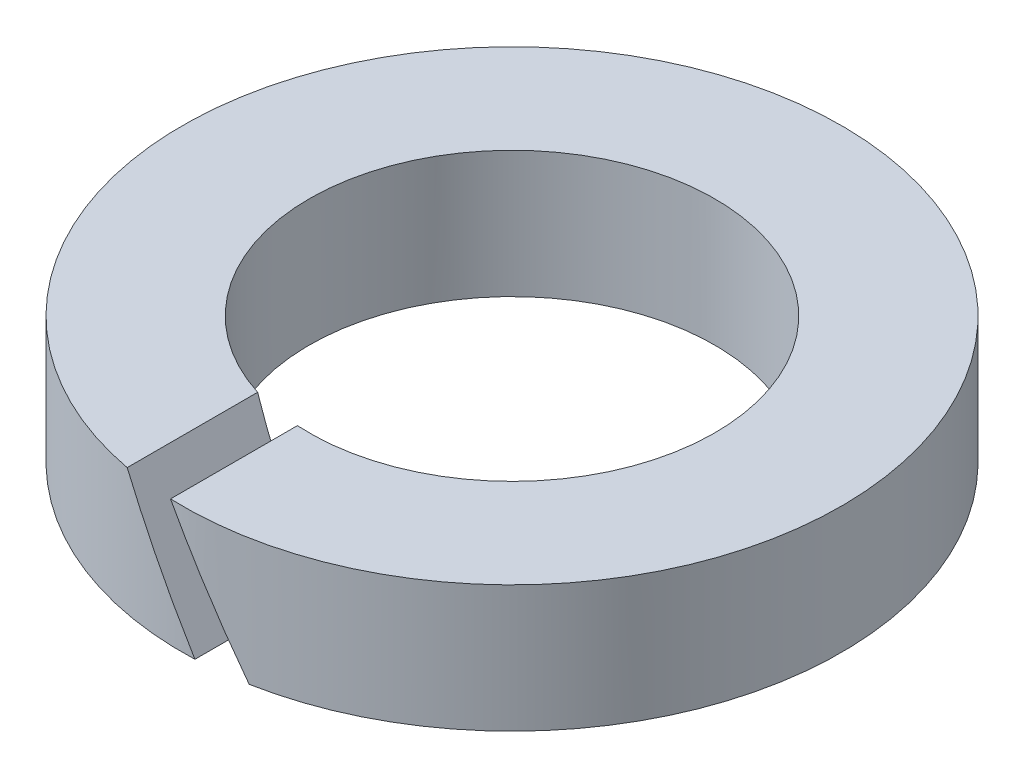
ISO-10303-21;
HEADER;
FILE_DESCRIPTION(('STEP AP214'),'2;1');
FILE_NAME('part.step','',(''),(''),'','','');
FILE_SCHEMA(('AUTOMOTIVE_DESIGN { 1 0 10303 214 1 1 1 1 }'));
ENDSEC;
DATA;
#1=APPLICATION_CONTEXT('core data for automotive mechanical design processes');
#2=APPLICATION_PROTOCOL_DEFINITION('international standard','automotive_design',2000,#1);
#3=PRODUCT_CONTEXT('',#1,'mechanical');
#4=PRODUCT('Part','Part','',(#3));
#5=PRODUCT_RELATED_PRODUCT_CATEGORY('part','',(#4));
#6=PRODUCT_DEFINITION_FORMATION('','',#4);
#7=PRODUCT_DEFINITION_CONTEXT('part definition',#1,'design');
#8=PRODUCT_DEFINITION('design','',#6,#7);
#9=PRODUCT_DEFINITION_SHAPE('','',#8);
#10=(LENGTH_UNIT() NAMED_UNIT(*) SI_UNIT(.MILLI.,.METRE.));
#11=(NAMED_UNIT(*) PLANE_ANGLE_UNIT() SI_UNIT($,.RADIAN.));
#12=(NAMED_UNIT(*) SI_UNIT($,.STERADIAN.) SOLID_ANGLE_UNIT());
#13=UNCERTAINTY_MEASURE_WITH_UNIT(LENGTH_MEASURE(1.E-05),#10,'distance_accuracy_value','');
#14=(GEOMETRIC_REPRESENTATION_CONTEXT(3) GLOBAL_UNCERTAINTY_ASSIGNED_CONTEXT((#13)) GLOBAL_UNIT_ASSIGNED_CONTEXT((#10,
#11,#12)) REPRESENTATION_CONTEXT('',''));
#15=CARTESIAN_POINT('',(0.,0.,0.));
#16=DIRECTION('',(0.,0.,1.));
#17=DIRECTION('',(1.,0.,0.));
#18=AXIS2_PLACEMENT_3D('',#15,#16,#17);
#19=CARTESIAN_POINT('',(0.,80.,0.));
#20=DIRECTION('',(0.,1.,0.));
#21=DIRECTION('',(0.,0.,1.));
#22=AXIS2_PLACEMENT_3D('',#19,#20,#21);
#23=CYLINDRICAL_SURFACE('',#22,3.20000000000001);
#24=CARTESIAN_POINT('',(0.,0.66666666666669,0.));
#25=DIRECTION('',(-0.866025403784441,-0.499999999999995,0.));
#26=DIRECTION('',(-0.499999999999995,0.866025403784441,0.));
#27=AXIS2_PLACEMENT_3D('',#24,#25,#26);
#28=ELLIPSE('',#27,6.40000000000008,3.20000000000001);
#29=CARTESIAN_POINT('',(0.962250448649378,-1.,3.05189679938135));
#30=VERTEX_POINT('',#29);
#31=CARTESIAN_POINT('',(-0.192450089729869,1.,3.19420772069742));
#32=VERTEX_POINT('',#31);
#33=EDGE_CURVE('E54',#30,#32,#28,.T.);
#34=ORIENTED_EDGE('',*,*,#33,.T.);
#35=CARTESIAN_POINT('',(0.,1.,0.));
#36=DIRECTION('',(0.,1.,0.));
#37=DIRECTION('',(0.,0.,1.));
#38=AXIS2_PLACEMENT_3D('',#35,#36,#37);
#39=CIRCLE('',#38,3.20000000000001);
#40=CARTESIAN_POINT('',(-0.962250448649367,1.,3.05189679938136));
#41=VERTEX_POINT('',#40);
#42=EDGE_CURVE('E11',#32,#41,#39,.T.);
#43=ORIENTED_EDGE('',*,*,#42,.T.);
#44=CARTESIAN_POINT('',(0.,-0.666666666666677,0.));
#45=DIRECTION('',(-0.866025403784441,-0.499999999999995,0.));
#46=DIRECTION('',(-0.499999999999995,0.866025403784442,0.));
#47=AXIS2_PLACEMENT_3D('',#44,#45,#46);
#48=ELLIPSE('',#47,6.40000000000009,3.20000000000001);
#49=CARTESIAN_POINT('',(0.192450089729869,-1.,3.19420772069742));
#50=VERTEX_POINT('',#49);
#51=EDGE_CURVE('E70',#50,#41,#48,.T.);
#52=ORIENTED_EDGE('',*,*,#51,.F.);
#53=CARTESIAN_POINT('',(0.,-1.,0.));
#54=DIRECTION('',(0.,1.,0.));
#55=DIRECTION('',(0.,0.,1.));
#56=AXIS2_PLACEMENT_3D('',#53,#54,#55);
#57=CIRCLE('',#56,3.20000000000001);
#58=EDGE_CURVE('E78',#30,#50,#57,.T.);
#59=ORIENTED_EDGE('',*,*,#58,.F.);
#60=EDGE_LOOP('',(#34,#43,#52,#59));
#61=FACE_BOUND('',#60,.T.);
#62=ADVANCED_FACE('F32',(#61),#23,.F.);
#63=CARTESIAN_POINT('',(3.20000000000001,1.,0.));
#64=DIRECTION('',(0.,1.,0.));
#65=DIRECTION('',(0.,0.,1.));
#66=AXIS2_PLACEMENT_3D('',#63,#64,#65);
#67=PLANE('',#66);
#68=ORIENTED_EDGE('',*,*,#42,.F.);
#69=DIRECTION('',(0.,0.,-1.));
#70=VECTOR('',#69,1.);
#71=CARTESIAN_POINT('',(-0.192450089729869,1.,5.20100000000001));
#72=LINE('',#71,#70);
#73=CARTESIAN_POINT('',(-0.192450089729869,1.,5.19643752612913));
#74=VERTEX_POINT('',#73);
#75=EDGE_CURVE('E86',#74,#32,#72,.T.);
#76=ORIENTED_EDGE('',*,*,#75,.F.);
#77=CARTESIAN_POINT('',(0.,1.,0.));
#78=DIRECTION('',(0.,1.,0.));
#79=DIRECTION('',(0.,0.,1.));
#80=AXIS2_PLACEMENT_3D('',#77,#78,#79);
#81=CIRCLE('',#80,5.20000000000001);
#82=CARTESIAN_POINT('',(-0.962250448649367,1.,5.11019315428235));
#83=VERTEX_POINT('',#82);
#84=EDGE_CURVE('E39',#74,#83,#81,.T.);
#85=ORIENTED_EDGE('',*,*,#84,.T.);
#86=DIRECTION('',(0.,0.,-1.));
#87=VECTOR('',#86,1.);
#88=CARTESIAN_POINT('',(-0.962250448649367,1.,5.20100000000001));
#89=LINE('',#88,#87);
#90=EDGE_CURVE('E73',#83,#41,#89,.T.);
#91=ORIENTED_EDGE('',*,*,#90,.T.);
#92=EDGE_LOOP('',(#68,#76,#85,#91));
#93=FACE_BOUND('',#92,.T.);
#94=ADVANCED_FACE('F83',(#93),#67,.T.);
#95=CARTESIAN_POINT('',(0.,80.,0.));
#96=DIRECTION('',(0.,1.,0.));
#97=DIRECTION('',(0.,0.,1.));
#98=AXIS2_PLACEMENT_3D('',#95,#96,#97);
#99=CYLINDRICAL_SURFACE('',#98,5.20000000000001);
#100=CARTESIAN_POINT('',(0.,0.66666666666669,0.));
#101=DIRECTION('',(-0.866025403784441,-0.499999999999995,0.));
#102=DIRECTION('',(-0.499999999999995,0.866025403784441,0.));
#103=AXIS2_PLACEMENT_3D('',#100,#101,#102);
#104=ELLIPSE('',#103,10.4000000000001,5.20000000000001);
#105=CARTESIAN_POINT('',(0.962250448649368,-1.,5.11019315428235));
#106=VERTEX_POINT('',#105);
#107=EDGE_CURVE('E88',#74,#106,#104,.F.);
#108=ORIENTED_EDGE('',*,*,#107,.T.);
#109=CARTESIAN_POINT('',(0.,-1.,0.));
#110=DIRECTION('',(0.,1.,0.));
#111=DIRECTION('',(0.,0.,1.));
#112=AXIS2_PLACEMENT_3D('',#109,#110,#111);
#113=CIRCLE('',#112,5.20000000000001);
#114=CARTESIAN_POINT('',(0.192450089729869,-1.,5.19643752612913));
#115=VERTEX_POINT('',#114);
#116=EDGE_CURVE('E99',#106,#115,#113,.T.);
#117=ORIENTED_EDGE('',*,*,#116,.T.);
#118=CARTESIAN_POINT('',(0.,-0.666666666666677,0.));
#119=DIRECTION('',(-0.866025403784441,-0.499999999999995,0.));
#120=DIRECTION('',(-0.499999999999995,0.866025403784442,0.));
#121=AXIS2_PLACEMENT_3D('',#118,#119,#120);
#122=ELLIPSE('',#121,10.4000000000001,5.20000000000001);
#123=EDGE_CURVE('E46',#83,#115,#122,.F.);
#124=ORIENTED_EDGE('',*,*,#123,.F.);
#125=ORIENTED_EDGE('',*,*,#84,.F.);
#126=EDGE_LOOP('',(#108,#117,#124,#125));
#127=FACE_BOUND('',#126,.T.);
#128=ADVANCED_FACE('F103',(#127),#99,.T.);
#129=CARTESIAN_POINT('',(5.20000000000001,-1.,0.));
#130=DIRECTION('',(0.,-1.,0.));
#131=DIRECTION('',(0.,0.,-1.));
#132=AXIS2_PLACEMENT_3D('',#129,#130,#131);
#133=PLANE('',#132);
#134=ORIENTED_EDGE('',*,*,#116,.F.);
#135=DIRECTION('',(0.,0.,-1.));
#136=VECTOR('',#135,1.);
#137=CARTESIAN_POINT('',(0.962250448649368,-1.,5.20100000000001));
#138=LINE('',#137,#136);
#139=EDGE_CURVE('E95',#106,#30,#138,.T.);
#140=ORIENTED_EDGE('',*,*,#139,.T.);
#141=ORIENTED_EDGE('',*,*,#58,.T.);
#142=DIRECTION('',(0.,0.,-1.));
#143=VECTOR('',#142,1.);
#144=CARTESIAN_POINT('',(0.192450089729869,-1.,5.20100000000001));
#145=LINE('',#144,#143);
#146=EDGE_CURVE('E74',#115,#50,#145,.T.);
#147=ORIENTED_EDGE('',*,*,#146,.F.);
#148=EDGE_LOOP('',(#134,#140,#141,#147));
#149=FACE_BOUND('',#148,.T.);
#150=ADVANCED_FACE('F105',(#149),#133,.T.);
#151=CARTESIAN_POINT('',(0.192450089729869,-1.,5.20100000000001));
#152=DIRECTION('',(-0.866025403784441,-0.499999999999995,0.));
#153=DIRECTION('',(0.499999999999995,-0.866025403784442,0.));
#154=AXIS2_PLACEMENT_3D('',#151,#152,#153);
#155=PLANE('',#154);
#156=ORIENTED_EDGE('',*,*,#51,.T.);
#157=ORIENTED_EDGE('',*,*,#90,.F.);
#158=ORIENTED_EDGE('',*,*,#123,.T.);
#159=ORIENTED_EDGE('',*,*,#146,.T.);
#160=EDGE_LOOP('',(#156,#157,#158,#159));
#161=FACE_BOUND('',#160,.T.);
#162=ADVANCED_FACE('F72',(#161),#155,.F.);
#163=CARTESIAN_POINT('',(0.962250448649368,-1.,5.20100000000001));
#164=DIRECTION('',(-0.866025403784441,-0.499999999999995,0.));
#165=DIRECTION('',(0.499999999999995,-0.866025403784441,0.));
#166=AXIS2_PLACEMENT_3D('',#163,#164,#165);
#167=PLANE('',#166);
#168=ORIENTED_EDGE('',*,*,#139,.F.);
#169=ORIENTED_EDGE('',*,*,#107,.F.);
#170=ORIENTED_EDGE('',*,*,#75,.T.);
#171=ORIENTED_EDGE('',*,*,#33,.F.);
#172=EDGE_LOOP('',(#168,#169,#170,#171));
#173=FACE_BOUND('',#172,.T.);
#174=ADVANCED_FACE('F106',(#173),#167,.T.);
#175=CLOSED_SHELL('',(#62,#94,#128,#150,#162,#174));
#176=MANIFOLD_SOLID_BREP('B2',#175);
#177=ADVANCED_BREP_SHAPE_REPRESENTATION('',(#18,#176),#14);
#178=SHAPE_DEFINITION_REPRESENTATION(#9,#177);
ENDSEC;
END-ISO-10303-21;
